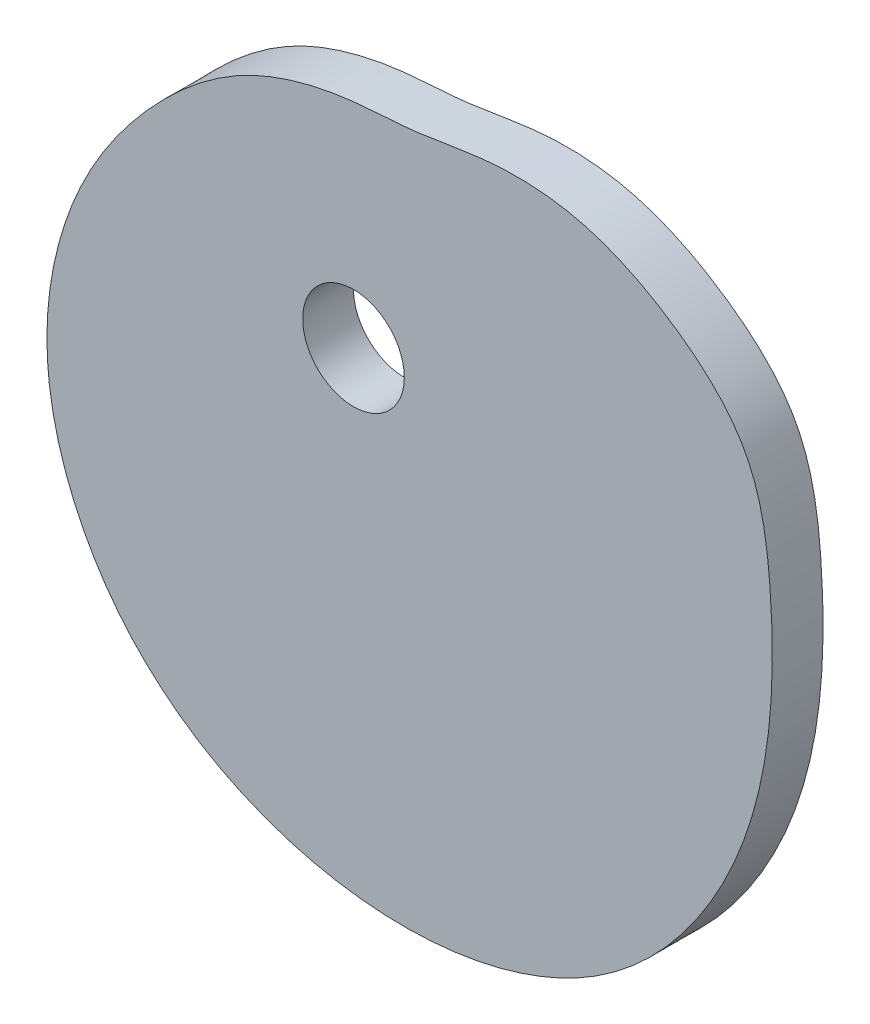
ISO-10303-21;
HEADER;
FILE_DESCRIPTION(('STEP AP214'),'2;1');
FILE_NAME('part.step','',(''),(''),'','','');
FILE_SCHEMA(('AUTOMOTIVE_DESIGN { 1 0 10303 214 1 1 1 1 }'));
ENDSEC;
DATA;
#1=APPLICATION_CONTEXT('core data for automotive mechanical design processes');
#2=APPLICATION_PROTOCOL_DEFINITION('international standard','automotive_design',2000,#1);
#3=PRODUCT_CONTEXT('',#1,'mechanical');
#4=PRODUCT('Part','Part','',(#3));
#5=PRODUCT_RELATED_PRODUCT_CATEGORY('part','',(#4));
#6=PRODUCT_DEFINITION_FORMATION('','',#4);
#7=PRODUCT_DEFINITION_CONTEXT('part definition',#1,'design');
#8=PRODUCT_DEFINITION('design','',#6,#7);
#9=PRODUCT_DEFINITION_SHAPE('','',#8);
#10=(LENGTH_UNIT() NAMED_UNIT(*) SI_UNIT(.MILLI.,.METRE.));
#11=(NAMED_UNIT(*) PLANE_ANGLE_UNIT() SI_UNIT($,.RADIAN.));
#12=(NAMED_UNIT(*) SI_UNIT($,.STERADIAN.) SOLID_ANGLE_UNIT());
#13=UNCERTAINTY_MEASURE_WITH_UNIT(LENGTH_MEASURE(1.E-05),#10,'distance_accuracy_value','');
#14=(GEOMETRIC_REPRESENTATION_CONTEXT(3) GLOBAL_UNCERTAINTY_ASSIGNED_CONTEXT((#13)) GLOBAL_UNIT_ASSIGNED_CONTEXT((#10,
#11,#12)) REPRESENTATION_CONTEXT('',''));
#15=CARTESIAN_POINT('',(0.,0.,0.));
#16=DIRECTION('',(0.,0.,1.));
#17=DIRECTION('',(1.,0.,0.));
#18=AXIS2_PLACEMENT_3D('',#15,#16,#17);
#19=CARTESIAN_POINT('',(27.2835282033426,-91.6603497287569,10.));
#20=DIRECTION('',(0.,0.,-1.));
#21=DIRECTION('',(-1.,0.,0.));
#22=AXIS2_PLACEMENT_3D('',#19,#20,#21);
#23=PLANE('',#22);
#24=CARTESIAN_POINT('',(0.,42.,10.));
#25=CARTESIAN_POINT('',(-7.26769603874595,41.1980959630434,10.));
#26=CARTESIAN_POINT('',(-22.0652017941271,37.3170660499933,10.));
#27=CARTESIAN_POINT('',(-40.7126051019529,21.7773031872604,10.));
#28=CARTESIAN_POINT('',(-57.1860529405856,-1.6763973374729,10.));
#29=CARTESIAN_POINT('',(-64.0314332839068,-37.5337987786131,10.));
#30=CARTESIAN_POINT('',(-44.6960965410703,-78.0704070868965,10.));
#31=CARTESIAN_POINT('',(0.132438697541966,-98.1435874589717,10.));
#32=CARTESIAN_POINT('',(51.1770060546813,-88.8190085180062,10.));
#33=CARTESIAN_POINT('',(81.0889741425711,-46.7241487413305,10.));
#34=CARTESIAN_POINT('',(83.643227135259,-8.19841080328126,10.));
#35=CARTESIAN_POINT('',(79.3685970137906,22.0806452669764,10.));
#36=CARTESIAN_POINT('',(62.8433516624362,36.625308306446,10.));
#37=CARTESIAN_POINT('',(44.8874384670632,45.1012516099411,10.));
#38=CARTESIAN_POINT('',(27.1760353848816,45.7954301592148,10.));
#39=CARTESIAN_POINT('',(12.738932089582,42.6785652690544,10.));
#40=CARTESIAN_POINT('',(4.00702052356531,42.4421271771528,10.));
#41=CARTESIAN_POINT('',(0.,42.,10.));
#42=B_SPLINE_CURVE_WITH_KNOTS('',3,(#24,#25,#26,#27,#28,#29,#30,#31,#32,#33,#34,#35,#36,#37,#38,
#39,#40,#41),.UNSPECIFIED.,.T.,.F.,(4,1,1,1,1,1,1,1,1,1,1,1,1,1,1,4),(0.,0.0491714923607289,
0.100511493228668,0.160459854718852,0.240408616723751,0.335074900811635,0.439807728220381,
0.550195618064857,0.65781668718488,0.75975351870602,0.808354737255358,0.856114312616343,
0.900461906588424,0.941049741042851,0.972889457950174,1.),.UNSPECIFIED.);
#43=CARTESIAN_POINT('',(0.,42.,10.));
#44=VERTEX_POINT('',#43);
#45=EDGE_CURVE('E10',#44,#44,#42,.T.);
#46=ORIENTED_EDGE('',*,*,#45,.T.);
#47=EDGE_LOOP('',(#46));
#48=FACE_BOUND('',#47,.T.);
#49=CARTESIAN_POINT('',(0.,0.,10.));
#50=DIRECTION('',(0.,0.,1.));
#51=DIRECTION('',(1.,0.,0.));
#52=AXIS2_PLACEMENT_3D('',#49,#50,#51);
#53=CIRCLE('',#52,10.);
#54=CARTESIAN_POINT('',(10.,0.,10.));
#55=VERTEX_POINT('',#54);
#56=EDGE_CURVE('E43',#55,#55,#53,.T.);
#57=ORIENTED_EDGE('',*,*,#56,.F.);
#58=EDGE_LOOP('',(#57));
#59=FACE_BOUND('',#58,.T.);
#60=ADVANCED_FACE('F29',(#48,#59),#23,.F.);
#61=CARTESIAN_POINT('',(27.2835282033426,-91.6603497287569,0.));
#62=DIRECTION('',(0.,0.,-1.));
#63=DIRECTION('',(-1.,0.,0.));
#64=AXIS2_PLACEMENT_3D('',#61,#62,#63);
#65=PLANE('',#64);
#66=CARTESIAN_POINT('',(0.,42.,0.));
#67=CARTESIAN_POINT('',(-7.26769603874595,41.1980959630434,0.));
#68=CARTESIAN_POINT('',(-22.0652017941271,37.3170660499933,0.));
#69=CARTESIAN_POINT('',(-40.7126051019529,21.7773031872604,0.));
#70=CARTESIAN_POINT('',(-57.1860529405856,-1.6763973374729,0.));
#71=CARTESIAN_POINT('',(-64.0314332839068,-37.5337987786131,0.));
#72=CARTESIAN_POINT('',(-44.6960965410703,-78.0704070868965,0.));
#73=CARTESIAN_POINT('',(0.132438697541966,-98.1435874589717,0.));
#74=CARTESIAN_POINT('',(51.1770060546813,-88.8190085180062,0.));
#75=CARTESIAN_POINT('',(81.0889741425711,-46.7241487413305,0.));
#76=CARTESIAN_POINT('',(83.643227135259,-8.19841080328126,0.));
#77=CARTESIAN_POINT('',(79.3685970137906,22.0806452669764,0.));
#78=CARTESIAN_POINT('',(62.8433516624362,36.625308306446,0.));
#79=CARTESIAN_POINT('',(44.8874384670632,45.1012516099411,0.));
#80=CARTESIAN_POINT('',(27.1760353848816,45.7954301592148,0.));
#81=CARTESIAN_POINT('',(12.738932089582,42.6785652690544,0.));
#82=CARTESIAN_POINT('',(4.00702052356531,42.4421271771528,0.));
#83=CARTESIAN_POINT('',(0.,42.,0.));
#84=B_SPLINE_CURVE_WITH_KNOTS('',3,(#66,#67,#68,#69,#70,#71,#72,#73,#74,#75,#76,#77,#78,#79,#80,
#81,#82,#83),.UNSPECIFIED.,.T.,.F.,(4,1,1,1,1,1,1,1,1,1,1,1,1,1,1,4),(0.,0.0491714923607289,
0.100511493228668,0.160459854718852,0.240408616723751,0.335074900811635,0.439807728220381,
0.550195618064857,0.65781668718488,0.75975351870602,0.808354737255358,0.856114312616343,
0.900461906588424,0.941049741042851,0.972889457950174,1.),.UNSPECIFIED.);
#85=CARTESIAN_POINT('',(0.,42.,0.));
#86=VERTEX_POINT('',#85);
#87=EDGE_CURVE('E39',#86,#86,#84,.T.);
#88=ORIENTED_EDGE('',*,*,#87,.F.);
#89=EDGE_LOOP('',(#88));
#90=FACE_BOUND('',#89,.T.);
#91=CARTESIAN_POINT('',(0.,0.,0.));
#92=DIRECTION('',(0.,0.,1.));
#93=DIRECTION('',(1.,0.,0.));
#94=AXIS2_PLACEMENT_3D('',#91,#92,#93);
#95=CIRCLE('',#94,10.);
#96=CARTESIAN_POINT('',(10.,0.,0.));
#97=VERTEX_POINT('',#96);
#98=EDGE_CURVE('E47',#97,#97,#95,.T.);
#99=ORIENTED_EDGE('',*,*,#98,.T.);
#100=EDGE_LOOP('',(#99));
#101=FACE_BOUND('',#100,.T.);
#102=ADVANCED_FACE('F58',(#90,#101),#65,.T.);
#103=DIRECTION('',(0.,0.,-1.));
#104=VECTOR('',#103,1.);
#105=SURFACE_OF_LINEAR_EXTRUSION('',#42,#104);
#106=ORIENTED_EDGE('',*,*,#45,.F.);
#107=EDGE_LOOP('',(#106));
#108=FACE_BOUND('',#107,.T.);
#109=ORIENTED_EDGE('',*,*,#87,.T.);
#110=EDGE_LOOP('',(#109));
#111=FACE_BOUND('',#110,.T.);
#112=ADVANCED_FACE('F31',(#108,#111),#105,.F.);
#113=CARTESIAN_POINT('',(0.,0.,10.));
#114=DIRECTION('',(0.,0.,-1.));
#115=DIRECTION('',(-1.,0.,0.));
#116=AXIS2_PLACEMENT_3D('',#113,#114,#115);
#117=CYLINDRICAL_SURFACE('',#116,10.);
#118=ORIENTED_EDGE('',*,*,#56,.T.);
#119=EDGE_LOOP('',(#118));
#120=FACE_BOUND('',#119,.T.);
#121=ORIENTED_EDGE('',*,*,#98,.F.);
#122=EDGE_LOOP('',(#121));
#123=FACE_BOUND('',#122,.T.);
#124=ADVANCED_FACE('F60',(#120,#123),#117,.F.);
#125=CLOSED_SHELL('',(#60,#102,#112,#124));
#126=MANIFOLD_SOLID_BREP('B2',#125);
#127=ADVANCED_BREP_SHAPE_REPRESENTATION('',(#18,#126),#14);
#128=SHAPE_DEFINITION_REPRESENTATION(#9,#127);
ENDSEC;
END-ISO-10303-21;
